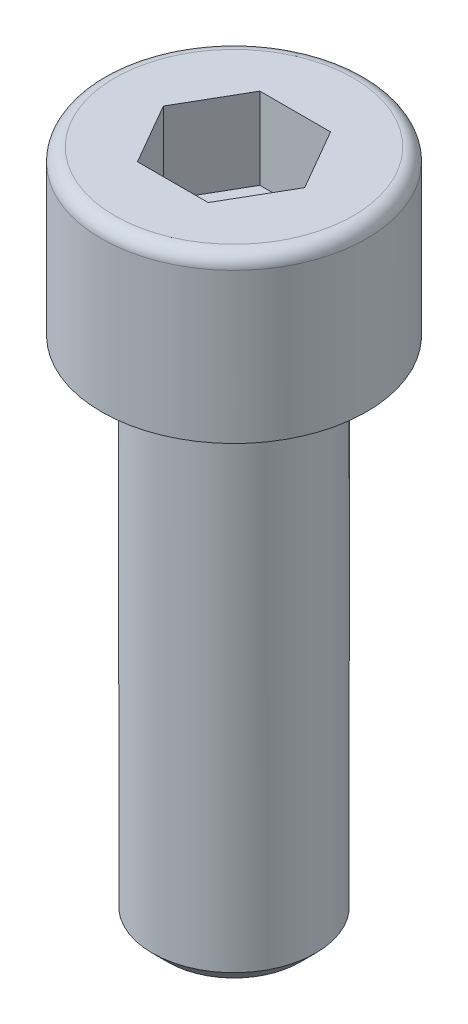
ISO-10303-21;
HEADER;
FILE_DESCRIPTION(('STEP AP214'),'2;1');
FILE_NAME('part.step','',(''),(''),'','','');
FILE_SCHEMA(('AUTOMOTIVE_DESIGN { 1 0 10303 214 1 1 1 1 }'));
ENDSEC;
DATA;
#1=APPLICATION_CONTEXT('core data for automotive mechanical design processes');
#2=APPLICATION_PROTOCOL_DEFINITION('international standard','automotive_design',2000,#1);
#3=PRODUCT_CONTEXT('',#1,'mechanical');
#4=PRODUCT('Part','Part','',(#3));
#5=PRODUCT_RELATED_PRODUCT_CATEGORY('part','',(#4));
#6=PRODUCT_DEFINITION_FORMATION('','',#4);
#7=PRODUCT_DEFINITION_CONTEXT('part definition',#1,'design');
#8=PRODUCT_DEFINITION('design','',#6,#7);
#9=PRODUCT_DEFINITION_SHAPE('','',#8);
#10=(LENGTH_UNIT() NAMED_UNIT(*) SI_UNIT(.MILLI.,.METRE.));
#11=(NAMED_UNIT(*) PLANE_ANGLE_UNIT() SI_UNIT($,.RADIAN.));
#12=(NAMED_UNIT(*) SI_UNIT($,.STERADIAN.) SOLID_ANGLE_UNIT());
#13=UNCERTAINTY_MEASURE_WITH_UNIT(LENGTH_MEASURE(1.E-05),#10,'distance_accuracy_value','');
#14=(GEOMETRIC_REPRESENTATION_CONTEXT(3) GLOBAL_UNCERTAINTY_ASSIGNED_CONTEXT((#13)) GLOBAL_UNIT_ASSIGNED_CONTEXT((#10,
#11,#12)) REPRESENTATION_CONTEXT('',''));
#15=CARTESIAN_POINT('',(0.,0.,0.));
#16=DIRECTION('',(0.,0.,1.));
#17=DIRECTION('',(1.,0.,0.));
#18=AXIS2_PLACEMENT_3D('',#15,#16,#17);
#19=CARTESIAN_POINT('',(-6.6776057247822,0.,-6.49999999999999));
#20=DIRECTION('',(0.,-1.,0.));
#21=DIRECTION('',(1.,0.,0.));
#22=AXIS2_PLACEMENT_3D('',#19,#20,#21);
#23=PLANE('',#22);
#24=CARTESIAN_POINT('',(0.,0.,0.));
#25=DIRECTION('',(0.,-1.,0.));
#26=DIRECTION('',(0.,0.,1.));
#27=AXIS2_PLACEMENT_3D('',#24,#25,#26);
#28=CIRCLE('',#27,6.5);
#29=CARTESIAN_POINT('',(0.,0.,6.5));
#30=VERTEX_POINT('',#29);
#31=EDGE_CURVE('E112',#30,#30,#28,.F.);
#32=ORIENTED_EDGE('',*,*,#31,.F.);
#33=EDGE_LOOP('',(#32));
#34=FACE_BOUND('',#33,.T.);
#35=CARTESIAN_POINT('',(0.,0.,0.));
#36=DIRECTION('',(0.,-1.,0.));
#37=DIRECTION('',(0.,0.,-1.));
#38=AXIS2_PLACEMENT_3D('',#35,#36,#37);
#39=CIRCLE('',#38,4.);
#40=CARTESIAN_POINT('',(0.,0.,-4.));
#41=VERTEX_POINT('',#40);
#42=EDGE_CURVE('E106',#41,#41,#39,.T.);
#43=ORIENTED_EDGE('',*,*,#42,.F.);
#44=EDGE_LOOP('',(#43));
#45=FACE_BOUND('',#44,.T.);
#46=ADVANCED_FACE('F14',(#34,#45),#23,.T.);
#47=CARTESIAN_POINT('',(-6.00984515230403,8.,5.85000000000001));
#48=DIRECTION('',(0.,1.,0.));
#49=DIRECTION('',(1.,0.,0.));
#50=AXIS2_PLACEMENT_3D('',#47,#48,#49);
#51=PLANE('',#50);
#52=CARTESIAN_POINT('',(0.,8.,0.));
#53=DIRECTION('',(0.,1.,0.));
#54=DIRECTION('',(0.,0.,-1.));
#55=AXIS2_PLACEMENT_3D('',#52,#53,#54);
#56=CIRCLE('',#55,5.85);
#57=CARTESIAN_POINT('',(0.,8.,-5.85));
#58=VERTEX_POINT('',#57);
#59=EDGE_CURVE('E115',#58,#58,#56,.T.);
#60=ORIENTED_EDGE('',*,*,#59,.T.);
#61=EDGE_LOOP('',(#60));
#62=FACE_BOUND('',#61,.T.);
#63=DIRECTION('',(0.5,0.,-0.866025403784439));
#64=VECTOR('',#63,1.);
#65=CARTESIAN_POINT('',(1.73205080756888,8.,3.));
#66=LINE('',#65,#64);
#67=CARTESIAN_POINT('',(1.73205080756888,8.,3.));
#68=VERTEX_POINT('',#67);
#69=CARTESIAN_POINT('',(3.46410161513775,8.,7.49400541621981E-13));
#70=VERTEX_POINT('',#69);
#71=EDGE_CURVE('E80',#68,#70,#66,.T.);
#72=ORIENTED_EDGE('',*,*,#71,.F.);
#73=DIRECTION('',(1.,0.,0.));
#74=VECTOR('',#73,1.);
#75=CARTESIAN_POINT('',(-1.73205080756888,8.,3.));
#76=LINE('',#75,#74);
#77=CARTESIAN_POINT('',(-1.73205080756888,8.,3.));
#78=VERTEX_POINT('',#77);
#79=EDGE_CURVE('E93',#78,#68,#76,.T.);
#80=ORIENTED_EDGE('',*,*,#79,.F.);
#81=DIRECTION('',(0.5,0.,0.866025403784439));
#82=VECTOR('',#81,1.);
#83=CARTESIAN_POINT('',(-3.46410161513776,8.,0.));
#84=LINE('',#83,#82);
#85=CARTESIAN_POINT('',(-3.46410161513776,8.,0.));
#86=VERTEX_POINT('',#85);
#87=EDGE_CURVE('E87',#86,#78,#84,.T.);
#88=ORIENTED_EDGE('',*,*,#87,.F.);
#89=DIRECTION('',(-0.5,0.,0.866025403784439));
#90=VECTOR('',#89,1.);
#91=CARTESIAN_POINT('',(-1.73205080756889,8.,-3.));
#92=LINE('',#91,#90);
#93=CARTESIAN_POINT('',(-1.73205080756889,8.,-3.));
#94=VERTEX_POINT('',#93);
#95=EDGE_CURVE('E85',#94,#86,#92,.T.);
#96=ORIENTED_EDGE('',*,*,#95,.F.);
#97=DIRECTION('',(-1.,0.,0.));
#98=VECTOR('',#97,1.);
#99=CARTESIAN_POINT('',(1.73205080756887,8.,-3.));
#100=LINE('',#99,#98);
#101=CARTESIAN_POINT('',(1.73205080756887,8.,-3.));
#102=VERTEX_POINT('',#101);
#103=EDGE_CURVE('E69',#102,#94,#100,.T.);
#104=ORIENTED_EDGE('',*,*,#103,.F.);
#105=DIRECTION('',(-0.5,0.,-0.866025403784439));
#106=VECTOR('',#105,1.);
#107=CARTESIAN_POINT('',(3.46410161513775,8.,7.49400541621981E-13));
#108=LINE('',#107,#106);
#109=EDGE_CURVE('E75',#70,#102,#108,.T.);
#110=ORIENTED_EDGE('',*,*,#109,.F.);
#111=EDGE_LOOP('',(#72,#80,#88,#96,#104,#110));
#112=FACE_BOUND('',#111,.T.);
#113=ADVANCED_FACE('F82',(#62,#112),#51,.T.);
#114=CARTESIAN_POINT('',(0.,8.,0.));
#115=DIRECTION('',(0.,1.,0.));
#116=DIRECTION('',(0.,0.,-1.));
#117=AXIS2_PLACEMENT_3D('',#114,#115,#116);
#118=CYLINDRICAL_SURFACE('',#117,6.5);
#119=CARTESIAN_POINT('',(0.,7.35,0.));
#120=DIRECTION('',(0.,-1.,0.));
#121=DIRECTION('',(0.,0.,1.));
#122=AXIS2_PLACEMENT_3D('',#119,#120,#121);
#123=CIRCLE('',#122,6.5);
#124=CARTESIAN_POINT('',(0.,7.35,6.5));
#125=VERTEX_POINT('',#124);
#126=EDGE_CURVE('E9',#125,#125,#123,.F.);
#127=ORIENTED_EDGE('',*,*,#126,.F.);
#128=EDGE_LOOP('',(#127));
#129=FACE_BOUND('',#128,.T.);
#130=ORIENTED_EDGE('',*,*,#31,.T.);
#131=EDGE_LOOP('',(#130));
#132=FACE_BOUND('',#131,.T.);
#133=ADVANCED_FACE('F136',(#129,#132),#118,.T.);
#134=CARTESIAN_POINT('',(0.,7.35000000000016,0.));
#135=DIRECTION('',(0.,1.,0.));
#136=DIRECTION('',(0.,0.,-1.));
#137=AXIS2_PLACEMENT_3D('',#134,#135,#136);
#138=TOROIDAL_SURFACE('',#137,5.85000000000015,0.64999999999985);
#139=ORIENTED_EDGE('',*,*,#126,.T.);
#140=EDGE_LOOP('',(#139));
#141=FACE_BOUND('',#140,.T.);
#142=ORIENTED_EDGE('',*,*,#59,.F.);
#143=EDGE_LOOP('',(#142));
#144=FACE_BOUND('',#143,.T.);
#145=ADVANCED_FACE('F16',(#141,#144),#138,.T.);
#146=CARTESIAN_POINT('',(-3.23300000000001,-25.,-3.233));
#147=DIRECTION('',(0.,-1.,0.));
#148=DIRECTION('',(1.,0.,0.));
#149=AXIS2_PLACEMENT_3D('',#146,#147,#148);
#150=PLANE('',#149);
#151=CARTESIAN_POINT('',(0.,-25.,0.));
#152=DIRECTION('',(0.,-1.,0.));
#153=DIRECTION('',(0.,0.,1.));
#154=AXIS2_PLACEMENT_3D('',#151,#152,#153);
#155=CIRCLE('',#154,3.233);
#156=CARTESIAN_POINT('',(0.,-25.,3.233));
#157=VERTEX_POINT('',#156);
#158=EDGE_CURVE('E109',#157,#157,#155,.F.);
#159=ORIENTED_EDGE('',*,*,#158,.F.);
#160=EDGE_LOOP('',(#159));
#161=FACE_BOUND('',#160,.T.);
#162=ADVANCED_FACE('F126',(#161),#150,.T.);
#163=CARTESIAN_POINT('',(0.,-24.233,0.));
#164=DIRECTION('',(0.,1.,0.));
#165=DIRECTION('',(1.92328497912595E-10,0.,-1.));
#166=AXIS2_PLACEMENT_3D('',#163,#164,#165);
#167=CONICAL_SURFACE('',#166,4.,0.785398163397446);
#168=CARTESIAN_POINT('',(0.,-24.233,0.));
#169=DIRECTION('',(0.,-1.,0.));
#170=DIRECTION('',(0.,0.,1.));
#171=AXIS2_PLACEMENT_3D('',#168,#169,#170);
#172=CIRCLE('',#171,4.);
#173=CARTESIAN_POINT('',(0.,-24.233,4.));
#174=VERTEX_POINT('',#173);
#175=EDGE_CURVE('E22',#174,#174,#172,.F.);
#176=ORIENTED_EDGE('',*,*,#175,.F.);
#177=EDGE_LOOP('',(#176));
#178=FACE_BOUND('',#177,.T.);
#179=ORIENTED_EDGE('',*,*,#158,.T.);
#180=EDGE_LOOP('',(#179));
#181=FACE_BOUND('',#180,.T.);
#182=ADVANCED_FACE('F123',(#178,#181),#167,.T.);
#183=CARTESIAN_POINT('',(0.,8.,0.));
#184=DIRECTION('',(0.,1.,0.));
#185=DIRECTION('',(7.69313624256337E-10,0.,-1.));
#186=AXIS2_PLACEMENT_3D('',#183,#184,#185);
#187=CYLINDRICAL_SURFACE('',#186,4.);
#188=ORIENTED_EDGE('',*,*,#175,.T.);
#189=EDGE_LOOP('',(#188));
#190=FACE_BOUND('',#189,.T.);
#191=ORIENTED_EDGE('',*,*,#42,.T.);
#192=EDGE_LOOP('',(#191));
#193=FACE_BOUND('',#192,.T.);
#194=ADVANCED_FACE('F120',(#190,#193),#187,.T.);
#195=CARTESIAN_POINT('',(3.46410161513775,-6.92180540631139,0.));
#196=DIRECTION('',(0.866025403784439,0.,-0.5));
#197=DIRECTION('',(-0.5,0.,-0.866025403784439));
#198=AXIS2_PLACEMENT_3D('',#195,#196,#197);
#199=PLANE('',#198);
#200=DIRECTION('',(0.,1.,0.));
#201=VECTOR('',#200,1.);
#202=CARTESIAN_POINT('',(1.73205080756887,-6.92180540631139,-3.));
#203=LINE('',#202,#201);
#204=CARTESIAN_POINT('',(1.73205080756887,4.,-3.));
#205=VERTEX_POINT('',#204);
#206=EDGE_CURVE('E65',#205,#102,#203,.T.);
#207=ORIENTED_EDGE('',*,*,#206,.F.);
#208=DIRECTION('',(0.5,0.,0.866025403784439));
#209=VECTOR('',#208,1.);
#210=CARTESIAN_POINT('',(3.46410161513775,4.,0.));
#211=LINE('',#210,#209);
#212=CARTESIAN_POINT('',(3.46410161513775,4.,0.));
#213=VERTEX_POINT('',#212);
#214=EDGE_CURVE('E29',#205,#213,#211,.T.);
#215=ORIENTED_EDGE('',*,*,#214,.T.);
#216=DIRECTION('',(0.,1.,0.));
#217=VECTOR('',#216,1.);
#218=CARTESIAN_POINT('',(3.46410161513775,-6.92180540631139,0.));
#219=LINE('',#218,#217);
#220=EDGE_CURVE('E72',#213,#70,#219,.T.);
#221=ORIENTED_EDGE('',*,*,#220,.T.);
#222=ORIENTED_EDGE('',*,*,#109,.T.);
#223=EDGE_LOOP('',(#207,#215,#221,#222));
#224=FACE_BOUND('',#223,.T.);
#225=ADVANCED_FACE('F76',(#224),#199,.F.);
#226=CARTESIAN_POINT('',(1.73205080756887,-6.92180540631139,-3.));
#227=DIRECTION('',(0.,0.,-1.));
#228=DIRECTION('',(-1.,0.,0.));
#229=AXIS2_PLACEMENT_3D('',#226,#227,#228);
#230=PLANE('',#229);
#231=DIRECTION('',(0.,1.,0.));
#232=VECTOR('',#231,1.);
#233=CARTESIAN_POINT('',(-1.73205080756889,-6.92180540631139,-2.99999999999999));
#234=LINE('',#233,#232);
#235=CARTESIAN_POINT('',(-1.73205080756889,4.,-3.));
#236=VERTEX_POINT('',#235);
#237=EDGE_CURVE('E71',#236,#94,#234,.T.);
#238=ORIENTED_EDGE('',*,*,#237,.F.);
#239=DIRECTION('',(1.,0.,0.));
#240=VECTOR('',#239,1.);
#241=CARTESIAN_POINT('',(1.73205080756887,4.,-3.));
#242=LINE('',#241,#240);
#243=EDGE_CURVE('E37',#236,#205,#242,.T.);
#244=ORIENTED_EDGE('',*,*,#243,.T.);
#245=ORIENTED_EDGE('',*,*,#206,.T.);
#246=ORIENTED_EDGE('',*,*,#103,.T.);
#247=EDGE_LOOP('',(#238,#244,#245,#246));
#248=FACE_BOUND('',#247,.T.);
#249=ADVANCED_FACE('F67',(#248),#230,.F.);
#250=CARTESIAN_POINT('',(-1.73205080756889,-6.92180540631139,-2.99999999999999));
#251=DIRECTION('',(-0.866025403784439,0.,-0.5));
#252=DIRECTION('',(-0.5,0.,0.866025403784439));
#253=AXIS2_PLACEMENT_3D('',#250,#251,#252);
#254=PLANE('',#253);
#255=DIRECTION('',(0.,1.,0.));
#256=VECTOR('',#255,1.);
#257=CARTESIAN_POINT('',(-3.46410161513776,-6.92180540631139,7.49400541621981E-13));
#258=LINE('',#257,#256);
#259=CARTESIAN_POINT('',(-3.46410161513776,4.,0.));
#260=VERTEX_POINT('',#259);
#261=EDGE_CURVE('E100',#260,#86,#258,.T.);
#262=ORIENTED_EDGE('',*,*,#261,.F.);
#263=DIRECTION('',(0.5,0.,-0.866025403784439));
#264=VECTOR('',#263,1.);
#265=CARTESIAN_POINT('',(-1.73205080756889,4.,-3.));
#266=LINE('',#265,#264);
#267=EDGE_CURVE('E269',#260,#236,#266,.T.);
#268=ORIENTED_EDGE('',*,*,#267,.T.);
#269=ORIENTED_EDGE('',*,*,#237,.T.);
#270=ORIENTED_EDGE('',*,*,#95,.T.);
#271=EDGE_LOOP('',(#262,#268,#269,#270));
#272=FACE_BOUND('',#271,.T.);
#273=ADVANCED_FACE('F208',(#272),#254,.F.);
#274=CARTESIAN_POINT('',(-3.46410161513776,-6.92180540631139,7.49400541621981E-13));
#275=DIRECTION('',(-0.866025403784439,0.,0.5));
#276=DIRECTION('',(0.5,0.,0.866025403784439));
#277=AXIS2_PLACEMENT_3D('',#274,#275,#276);
#278=PLANE('',#277);
#279=DIRECTION('',(0.,1.,0.));
#280=VECTOR('',#279,1.);
#281=CARTESIAN_POINT('',(-1.73205080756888,-6.92180540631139,3.));
#282=LINE('',#281,#280);
#283=CARTESIAN_POINT('',(-1.73205080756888,4.,3.));
#284=VERTEX_POINT('',#283);
#285=EDGE_CURVE('E98',#284,#78,#282,.T.);
#286=ORIENTED_EDGE('',*,*,#285,.F.);
#287=DIRECTION('',(-0.5,0.,-0.866025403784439));
#288=VECTOR('',#287,1.);
#289=CARTESIAN_POINT('',(-3.46410161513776,4.,0.));
#290=LINE('',#289,#288);
#291=EDGE_CURVE('E264',#284,#260,#290,.T.);
#292=ORIENTED_EDGE('',*,*,#291,.T.);
#293=ORIENTED_EDGE('',*,*,#261,.T.);
#294=ORIENTED_EDGE('',*,*,#87,.T.);
#295=EDGE_LOOP('',(#286,#292,#293,#294));
#296=FACE_BOUND('',#295,.T.);
#297=ADVANCED_FACE('F217',(#296),#278,.F.);
#298=CARTESIAN_POINT('',(-1.73205080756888,-6.92180540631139,3.));
#299=DIRECTION('',(0.,0.,1.));
#300=DIRECTION('',(1.,0.,0.));
#301=AXIS2_PLACEMENT_3D('',#298,#299,#300);
#302=PLANE('',#301);
#303=DIRECTION('',(0.,1.,0.));
#304=VECTOR('',#303,1.);
#305=CARTESIAN_POINT('',(1.73205080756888,-6.92180540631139,3.));
#306=LINE('',#305,#304);
#307=CARTESIAN_POINT('',(1.73205080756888,4.,3.));
#308=VERTEX_POINT('',#307);
#309=EDGE_CURVE('E96',#308,#68,#306,.T.);
#310=ORIENTED_EDGE('',*,*,#309,.F.);
#311=DIRECTION('',(-1.,0.,0.));
#312=VECTOR('',#311,1.);
#313=CARTESIAN_POINT('',(-1.73205080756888,4.,3.));
#314=LINE('',#313,#312);
#315=EDGE_CURVE('E262',#308,#284,#314,.T.);
#316=ORIENTED_EDGE('',*,*,#315,.T.);
#317=ORIENTED_EDGE('',*,*,#285,.T.);
#318=ORIENTED_EDGE('',*,*,#79,.T.);
#319=EDGE_LOOP('',(#310,#316,#317,#318));
#320=FACE_BOUND('',#319,.T.);
#321=ADVANCED_FACE('F227',(#320),#302,.F.);
#322=CARTESIAN_POINT('',(1.73205080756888,-6.92180540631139,3.));
#323=DIRECTION('',(0.866025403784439,0.,0.5));
#324=DIRECTION('',(0.5,0.,-0.866025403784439));
#325=AXIS2_PLACEMENT_3D('',#322,#323,#324);
#326=PLANE('',#325);
#327=ORIENTED_EDGE('',*,*,#220,.F.);
#328=DIRECTION('',(-0.5,0.,0.866025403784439));
#329=VECTOR('',#328,1.);
#330=CARTESIAN_POINT('',(1.73205080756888,4.,3.));
#331=LINE('',#330,#329);
#332=EDGE_CURVE('E105',#213,#308,#331,.T.);
#333=ORIENTED_EDGE('',*,*,#332,.T.);
#334=ORIENTED_EDGE('',*,*,#309,.T.);
#335=ORIENTED_EDGE('',*,*,#71,.T.);
#336=EDGE_LOOP('',(#327,#333,#334,#335));
#337=FACE_BOUND('',#336,.T.);
#338=ADVANCED_FACE('F152',(#337),#326,.F.);
#339=CARTESIAN_POINT('',(0.,4.,1.7875));
#340=DIRECTION('',(0.,1.,0.));
#341=DIRECTION('',(0.,0.,1.));
#342=AXIS2_PLACEMENT_3D('',#339,#340,#341);
#343=PLANE('',#342);
#344=ORIENTED_EDGE('',*,*,#332,.F.);
#345=ORIENTED_EDGE('',*,*,#214,.F.);
#346=ORIENTED_EDGE('',*,*,#243,.F.);
#347=ORIENTED_EDGE('',*,*,#267,.F.);
#348=ORIENTED_EDGE('',*,*,#291,.F.);
#349=ORIENTED_EDGE('',*,*,#315,.F.);
#350=EDGE_LOOP('',(#344,#345,#346,#347,#348,#349));
#351=FACE_BOUND('',#350,.T.);
#352=ADVANCED_FACE('F150',(#351),#343,.T.);
#353=CLOSED_SHELL('',(#46,#113,#133,#145,#162,#182,#194,#225,#249,#273,#297,#321,#338,#352));
#354=MANIFOLD_SOLID_BREP('B1',#353);
#355=ADVANCED_BREP_SHAPE_REPRESENTATION('',(#18,#354),#14);
#356=SHAPE_DEFINITION_REPRESENTATION(#9,#355);
ENDSEC;
END-ISO-10303-21;
